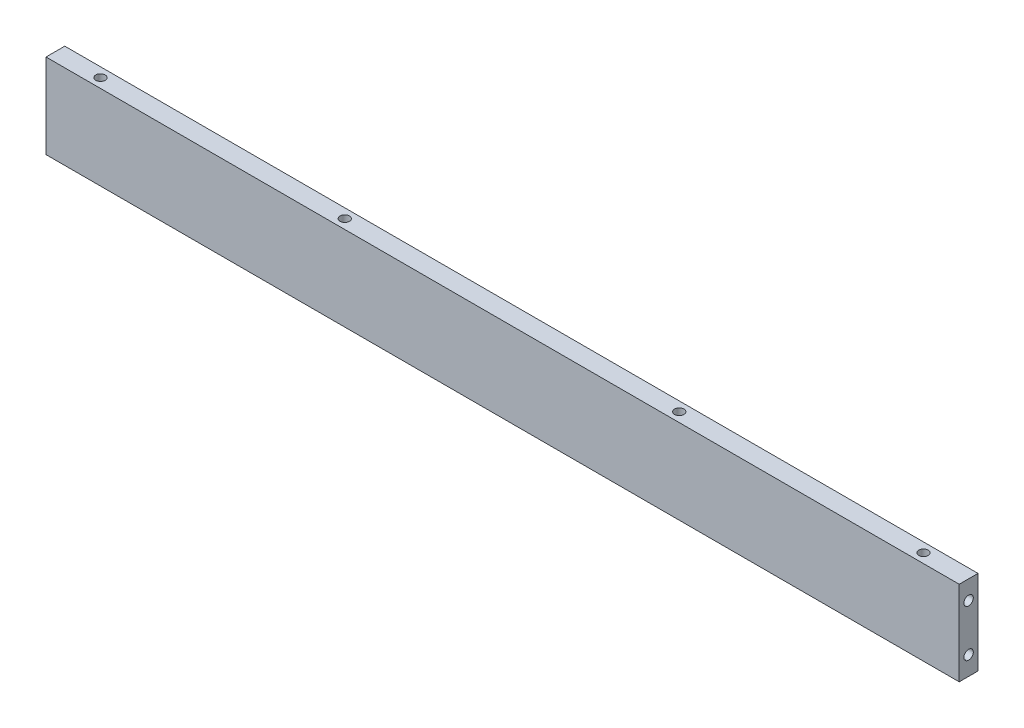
from build123d import *

# Parameters (mm, degrees)
SKETCH1_W           = 617.22
SKETCH1_H           = 57.15
BOSS_EXTRUDE1_DEPTH = 6.35
SKETCH2_R           = 3.175
CUT_EXTRUDE1_DEPTH  = 19.05
SKETCH3_R           = 3.175
CUT_EXTRUDE2_DEPTH  = 19.05


with BuildPart() as part:
    # Sketch1 → Boss-Extrude1 (new, symmetric)
    with BuildSketch(Plane.XY):
        Rectangle(SKETCH1_W, SKETCH1_H)
    extrude(amount=BOSS_EXTRUDE1_DEPTH, both=True)

    # Sketch2 → Cut-Extrude1 (cut)
    with BuildSketch(Plane(origin=(0, 28.575, 0), x_dir=(1, 0, 0), z_dir=(0, 1, 0))):
        with Locations(Location((278.13, 0, 0), (0, 0, 270))):
            Circle(SKETCH2_R)
        with Locations(Location((113.03, 0, 0), (0, 0, 270))):
            Circle(SKETCH2_R)
    cut_extrude1 = extrude(amount=-CUT_EXTRUDE1_DEPTH, mode=Mode.SUBTRACT)

    # Mirror1: Cut-Extrude1 across plane
    add(cut_extrude1.mirror(Plane(origin=(0, 0, 0), x_dir=(0, 0, 1), z_dir=(1, 0, 0))), mode=Mode.SUBTRACT)

    # Sketch3 → Cut-Extrude2 (cut)
    with BuildSketch(Plane(origin=(308.61, 0, 0), x_dir=(0, 0, -1), z_dir=(1, 0, 0))):
        with Locations((0, -15.875)):
            Circle(SKETCH3_R)
        with Locations((0, 15.875)):
            Circle(SKETCH3_R)
    cut_extrude2 = extrude(amount=-CUT_EXTRUDE2_DEPTH, mode=Mode.SUBTRACT)

    # Mirror2: Cut-Extrude2 across plane
    add(cut_extrude2.mirror(Plane(origin=(0, 0, 0), x_dir=(0, 0, 1), z_dir=(1, 0, 0))), mode=Mode.SUBTRACT)


solid = part.part
